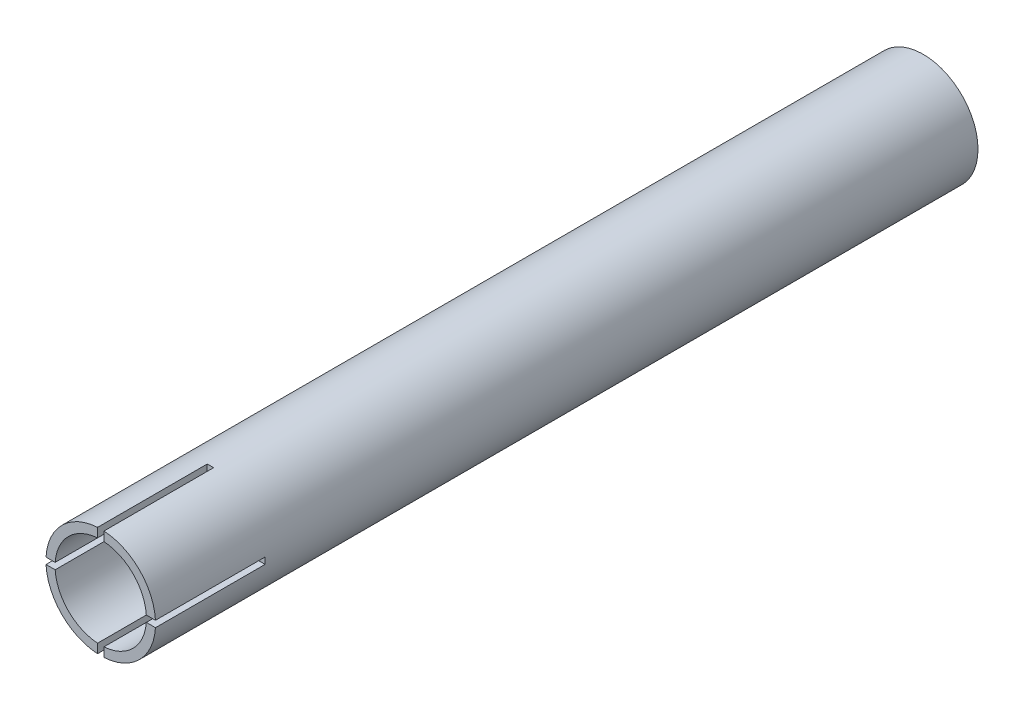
from build123d import *

# Parameters (mm, degrees)
SCHIZZO1_R                  = 6
SCHIZZO1_R_2                = 5
ESTRUSIONE_SOTTILE1_DEPTH   = 90
SCHIZZO2_W                  = 1.05353831
SCHIZZO2_H                  = 0.7
TAGLIO_ESTRUSIONE1_DEPTH    = 12
RIPETIZIONECIRCOLARE1_COUNT = 4


with BuildPart() as part:
    # Schizzo1 → Estrusione-Sottile1 (new body)
    with BuildSketch(Plane.XY):
        Circle(SCHIZZO1_R)
        Circle(SCHIZZO1_R_2, mode=Mode.SUBTRACT)
    extrude(amount=ESTRUSIONE_SOTTILE1_DEPTH)

    # Schizzo2 → Taglio-Estrusione1 (cut)
    with BuildSketch(Plane.XY.offset(90)):
        with Locations((-5.514504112, 0)):
            Rectangle(SCHIZZO2_W, SCHIZZO2_H)
    taglio_estrusione1 = extrude(amount=-TAGLIO_ESTRUSIONE1_DEPTH, mode=Mode.SUBTRACT)

    # RipetizioneCircolare1: Taglio-Estrusione1 ×4 about axis
    ripetizionecircolare1_axis = Axis((0, 0, 0), (0, 0, 1))
    for i in range(1, RIPETIZIONECIRCOLARE1_COUNT):
        add(taglio_estrusione1.rotate(ripetizionecircolare1_axis, i * 360 / RIPETIZIONECIRCOLARE1_COUNT), mode=Mode.SUBTRACT)


solid = part.part
